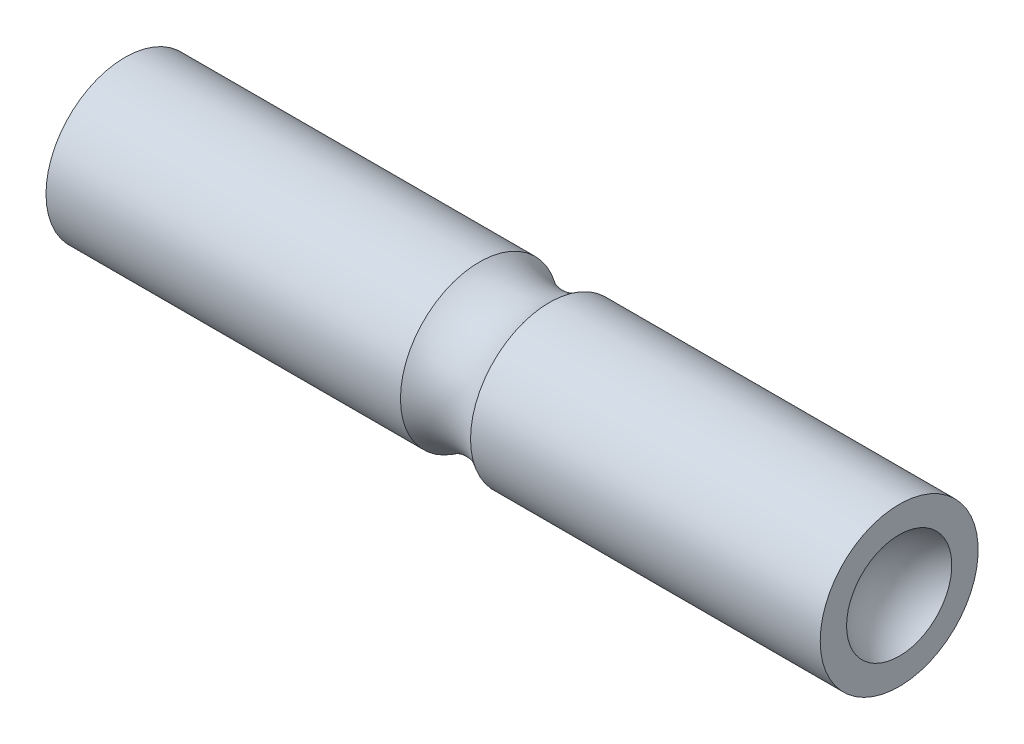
ISO-10303-21;
HEADER;
FILE_DESCRIPTION(('STEP AP214'),'2;1');
FILE_NAME('part.step','',(''),(''),'','','');
FILE_SCHEMA(('AUTOMOTIVE_DESIGN { 1 0 10303 214 1 1 1 1 }'));
ENDSEC;
DATA;
#1=APPLICATION_CONTEXT('core data for automotive mechanical design processes');
#2=APPLICATION_PROTOCOL_DEFINITION('international standard','automotive_design',2000,#1);
#3=PRODUCT_CONTEXT('',#1,'mechanical');
#4=PRODUCT('Part','Part','',(#3));
#5=PRODUCT_RELATED_PRODUCT_CATEGORY('part','',(#4));
#6=PRODUCT_DEFINITION_FORMATION('','',#4);
#7=PRODUCT_DEFINITION_CONTEXT('part definition',#1,'design');
#8=PRODUCT_DEFINITION('design','',#6,#7);
#9=PRODUCT_DEFINITION_SHAPE('','',#8);
#10=(LENGTH_UNIT() NAMED_UNIT(*) SI_UNIT(.MILLI.,.METRE.));
#11=(NAMED_UNIT(*) PLANE_ANGLE_UNIT() SI_UNIT($,.RADIAN.));
#12=(NAMED_UNIT(*) SI_UNIT($,.STERADIAN.) SOLID_ANGLE_UNIT());
#13=UNCERTAINTY_MEASURE_WITH_UNIT(LENGTH_MEASURE(1.E-05),#10,'distance_accuracy_value','');
#14=(GEOMETRIC_REPRESENTATION_CONTEXT(3) GLOBAL_UNCERTAINTY_ASSIGNED_CONTEXT((#13)) GLOBAL_UNIT_ASSIGNED_CONTEXT((#10,
#11,#12)) REPRESENTATION_CONTEXT('',''));
#15=CARTESIAN_POINT('',(0.,0.,0.));
#16=DIRECTION('',(0.,0.,1.));
#17=DIRECTION('',(1.,0.,0.));
#18=AXIS2_PLACEMENT_3D('',#15,#16,#17);
#19=CARTESIAN_POINT('',(4.064,0.,0.));
#20=DIRECTION('',(-1.,0.,0.));
#21=DIRECTION('',(0.,1.,0.));
#22=AXIS2_PLACEMENT_3D('',#19,#20,#21);
#23=SPHERICAL_SURFACE('',#22,4.064);
#24=CARTESIAN_POINT('',(0.515516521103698,0.,0.));
#25=DIRECTION('',(-1.,0.,0.));
#26=DIRECTION('',(0.,0.,1.));
#27=AXIS2_PLACEMENT_3D('',#24,#25,#26);
#28=CIRCLE('',#27,1.981);
#29=CARTESIAN_POINT('',(0.515516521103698,0.,1.981));
#30=VERTEX_POINT('',#29);
#31=EDGE_CURVE('E10',#30,#30,#28,.T.);
#32=ORIENTED_EDGE('',*,*,#31,.T.);
#33=EDGE_LOOP('',(#32));
#34=FACE_BOUND('',#33,.T.);
#35=ADVANCED_FACE('F30',(#34),#23,.T.);
#36=CARTESIAN_POINT('',(0.,0.,0.));
#37=DIRECTION('',(-1.,0.,0.));
#38=DIRECTION('',(0.,0.,1.));
#39=AXIS2_PLACEMENT_3D('',#36,#37,#38);
#40=CYLINDRICAL_SURFACE('',#39,1.981);
#41=ORIENTED_EDGE('',*,*,#31,.F.);
#42=EDGE_LOOP('',(#41));
#43=FACE_BOUND('',#42,.T.);
#44=CARTESIAN_POINT('',(9.40805119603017,0.,0.));
#45=DIRECTION('',(-1.,0.,0.));
#46=DIRECTION('',(0.,0.,1.));
#47=AXIS2_PLACEMENT_3D('',#44,#45,#46);
#48=CIRCLE('',#47,1.981);
#49=CARTESIAN_POINT('',(9.40805119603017,0.,1.981));
#50=VERTEX_POINT('',#49);
#51=EDGE_CURVE('E36',#50,#50,#48,.T.);
#52=ORIENTED_EDGE('',*,*,#51,.T.);
#53=EDGE_LOOP('',(#52));
#54=FACE_BOUND('',#53,.T.);
#55=ADVANCED_FACE('F65',(#43,#54),#40,.T.);
#56=CARTESIAN_POINT('',(10.287,0.,0.));
#57=DIRECTION('',(-1.,0.,0.));
#58=DIRECTION('',(0.,0.,1.));
#59=AXIS2_PLACEMENT_3D('',#56,#57,#58);
#60=TOROIDAL_SURFACE('',#59,3.226,1.524);
#61=ORIENTED_EDGE('',*,*,#51,.F.);
#62=EDGE_LOOP('',(#61));
#63=FACE_BOUND('',#62,.T.);
#64=CARTESIAN_POINT('',(11.1659488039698,0.,0.));
#65=DIRECTION('',(-1.,0.,0.));
#66=DIRECTION('',(0.,0.,1.));
#67=AXIS2_PLACEMENT_3D('',#64,#65,#66);
#68=CIRCLE('',#67,1.981);
#69=CARTESIAN_POINT('',(11.1659488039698,0.,1.981));
#70=VERTEX_POINT('',#69);
#71=EDGE_CURVE('E40',#70,#70,#68,.T.);
#72=ORIENTED_EDGE('',*,*,#71,.T.);
#73=EDGE_LOOP('',(#72));
#74=FACE_BOUND('',#73,.T.);
#75=ADVANCED_FACE('F69',(#63,#74),#60,.F.);
#76=CARTESIAN_POINT('',(0.,0.,0.));
#77=DIRECTION('',(-1.,0.,0.));
#78=DIRECTION('',(0.,0.,1.));
#79=AXIS2_PLACEMENT_3D('',#76,#77,#78);
#80=CYLINDRICAL_SURFACE('',#79,1.981);
#81=ORIENTED_EDGE('',*,*,#71,.F.);
#82=EDGE_LOOP('',(#81));
#83=FACE_BOUND('',#82,.T.);
#84=CARTESIAN_POINT('',(19.939,0.,0.));
#85=DIRECTION('',(-1.,0.,0.));
#86=DIRECTION('',(0.,0.,1.));
#87=AXIS2_PLACEMENT_3D('',#84,#85,#86);
#88=CIRCLE('',#87,1.981);
#89=CARTESIAN_POINT('',(19.939,0.,1.981));
#90=VERTEX_POINT('',#89);
#91=EDGE_CURVE('E44',#90,#90,#88,.T.);
#92=ORIENTED_EDGE('',*,*,#91,.T.);
#93=EDGE_LOOP('',(#92));
#94=FACE_BOUND('',#93,.T.);
#95=ADVANCED_FACE('F61',(#83,#94),#80,.T.);
#96=CARTESIAN_POINT('',(19.939,1.31982271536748,0.));
#97=DIRECTION('',(-1.,0.,0.));
#98=DIRECTION('',(0.,0.,1.));
#99=AXIS2_PLACEMENT_3D('',#96,#97,#98);
#100=PLANE('',#99);
#101=ORIENTED_EDGE('',*,*,#91,.F.);
#102=EDGE_LOOP('',(#101));
#103=FACE_BOUND('',#102,.T.);
#104=CARTESIAN_POINT('',(19.939,0.,0.));
#105=DIRECTION('',(-1.,0.,0.));
#106=DIRECTION('',(0.,0.,1.));
#107=AXIS2_PLACEMENT_3D('',#104,#105,#106);
#108=CIRCLE('',#107,1.31982271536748);
#109=CARTESIAN_POINT('',(19.939,0.,1.31982271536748));
#110=VERTEX_POINT('',#109);
#111=EDGE_CURVE('E49',#110,#110,#108,.T.);
#112=ORIENTED_EDGE('',*,*,#111,.T.);
#113=EDGE_LOOP('',(#112));
#114=FACE_BOUND('',#113,.T.);
#115=ADVANCED_FACE('F53',(#103,#114),#100,.F.);
#116=CARTESIAN_POINT('',(20.701,0.,0.));
#117=DIRECTION('',(-1.,0.,0.));
#118=DIRECTION('',(0.,-1.,0.));
#119=AXIS2_PLACEMENT_3D('',#116,#117,#118);
#120=SPHERICAL_SURFACE('',#119,1.524);
#121=ORIENTED_EDGE('',*,*,#111,.F.);
#122=EDGE_LOOP('',(#121));
#123=FACE_BOUND('',#122,.T.);
#124=ADVANCED_FACE('F55',(#123),#120,.F.);
#125=CLOSED_SHELL('',(#35,#55,#75,#95,#115,#124));
#126=MANIFOLD_SOLID_BREP('B2',#125);
#127=ADVANCED_BREP_SHAPE_REPRESENTATION('',(#18,#126),#14);
#128=SHAPE_DEFINITION_REPRESENTATION(#9,#127);
ENDSEC;
END-ISO-10303-21;
